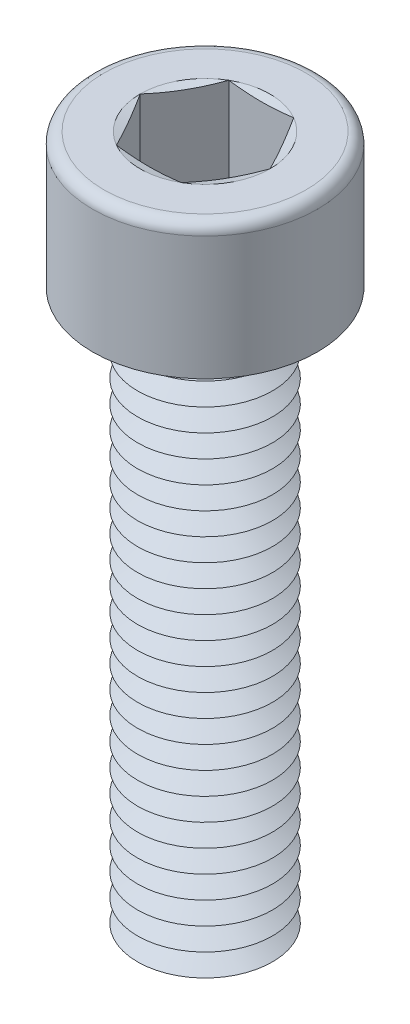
from build123d import *

# Parameters (mm, degrees)
SKETCH1_R       = 3
EXTRUDE1_DEPTH  = 25
SKETCH2_R       = 5
EXTRUDE2_DEPTH  = 6
EXTRUDE3_DEPTH  = 5
FILLET1_R       = 0.5
LPATTERN1_COUNT = 25
LPATTERN1_PITCH = 1


with BuildPart() as part:
    # Sketch1 → Extrude1 (new body)
    with BuildSketch(Plane(origin=(0, 0, 0), x_dir=(1, 0, 0), z_dir=(0, 1, 0))):
        with Locations(Location((0, 0, 0), (0, 0, 270))):
            Circle(SKETCH1_R)
    extrude(amount=EXTRUDE1_DEPTH)

    # Sketch2 → Extrude2 (add)
    with BuildSketch(Plane(origin=(0, 25, 0), x_dir=(1, 0, 0), z_dir=(0, 1, 0))):
        with Locations(Location((0, 0, 0), (0, 0, 270))):
            Circle(SKETCH2_R)
    extrude(amount=EXTRUDE2_DEPTH)

    # Sketch3 → Extrude3 (cut)
    with BuildSketch(Plane(origin=(0, 31, 0), x_dir=(1, 0, 0), z_dir=(0, 1, 0))):
        Polygon((1.443375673, 2.5), (-1.443375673, 2.5), (-2.886751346, 0), (-1.443375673, -2.5), (1.443375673, -2.5), (2.886751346, 0), align=None)
    extrude(amount=-EXTRUDE3_DEPTH, mode=Mode.SUBTRACT)

    # Fillet1
    fillet1_edges = [part.edges().sort_by_distance(p)[0] for p in [
        (0, 31, -5),
    ]]
    fillet(fillet1_edges, radius=FILLET1_R)

    # Sketch4 → Cut-Revolve1 (revolve, cut)
    with BuildSketch(Plane(origin=(0, 0, 0), x_dir=(0, 0, -1), z_dir=(1, 0, 0))):
        Polygon((-2.5, 26), (0, 26), (0, 24.556624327), align=None)
    revolve(axis=Axis((0, 26, 0), (0, -1, 0)), mode=Mode.SUBTRACT)

    # Sketch5 → Cut-Revolve2 (revolve, cut)
    with BuildSketch(Plane.XY, mode=Mode.PRIVATE) as cut_revolve2_sk:
        Polygon((-3, 0.5), (-3, -0.5), (-2.133974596, 0), align=None)
    cut_revolve2 = revolve(cut_revolve2_sk.sketch.rotate(Axis((0, 25, 0), (0, -1, 0)), 270), axis=Axis((0, 25, 0), (0, -1, 0)), mode=Mode.SUBTRACT)

    # LPattern1: Cut-Revolve2 ×25
    with Locations(*[(0, i * LPATTERN1_PITCH, 0) for i in range(1, LPATTERN1_COUNT)]):
        add(cut_revolve2, mode=Mode.SUBTRACT)

    # Extrude4 cone 1 section (on through the dimple's axis) → Extrude4 (revolve, cut)
    with BuildSketch(Plane(origin=(0, 31, 0), x_dir=(0, 0, 1), z_dir=(1, 0, 0))):
        Polygon((0, 0), (2.886751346, 0), (0, 0.773502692), align=None)
    revolve(axis=Axis((0, 31, 0), (0, -1, 0)), mode=Mode.SUBTRACT)


solid = part.part
